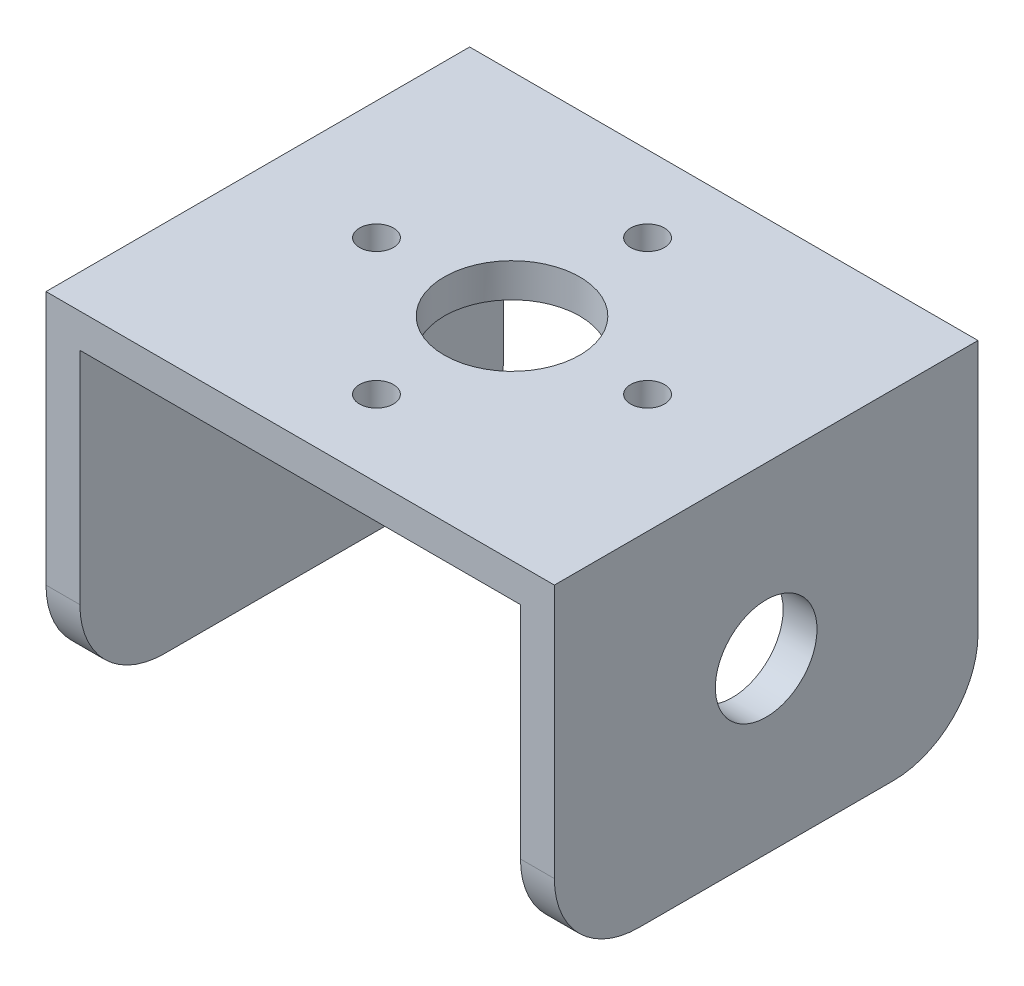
from build123d import *

# Parameters (mm, degrees)
SKETCH1_W           = 30
SKETCH1_H           = 25
BOSS_EXTRUDE1_DEPTH = 20
SHELL1_T            = -2
CUT_EXTRUDE1_REACH  = 29.951
SKETCH2_R           = 4
SKETCH2_R_2         = 1
SKETCH3_R           = 3
CUT_EXTRUDE2_DEPTH  = 39.160843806
FILLET1_R           = 5


with BuildPart() as part:
    # Sketch1 → Boss-Extrude1 (new body)
    with BuildSketch(Plane(origin=(0, 0, 0), x_dir=(1, 0, 0), z_dir=(0, 1, 0))):
        Rectangle(SKETCH1_W, SKETCH1_H)
    extrude(amount=-BOSS_EXTRUDE1_DEPTH)

    # Shell1
    shell1_openings = [part.faces().sort_by_distance(p)[0] for p in [
        (0, -20, 0),
        (0, -10, 12.5),
        (0, -10, -12.5),
    ]]
    offset(amount=SHELL1_T, openings=shell1_openings, kind=Kind.INTERSECTION)

    # Sketch2 → Cut-Extrude1 (cut, up to next)
    with BuildSketch(Plane(origin=(0, 0, 0), x_dir=(1, 0, 0), z_dir=(0, 1, 0)), mode=Mode.PRIVATE) as cut_extrude1_sk1:
        with Locations(Location((0, 0, 0), (0, 0, 270))):
            Circle(SKETCH2_R)
    cut_extrude1_tool1 = extrude(cut_extrude1_sk1.sketch, amount=-CUT_EXTRUDE1_REACH, mode=Mode.PRIVATE) & part.part
    # Sketch2 → Cut-Extrude1 (cut, up to next)
    with BuildSketch(Plane(origin=(0, 0, 0), x_dir=(1, 0, 0), z_dir=(0, 1, 0)), mode=Mode.PRIVATE) as cut_extrude1_sk2:
        with Locations(Location((0, 8, 0), (0, 0, 270))):
            Circle(SKETCH2_R_2)
    cut_extrude1_tool2 = extrude(cut_extrude1_sk2.sketch, amount=-CUT_EXTRUDE1_REACH, mode=Mode.PRIVATE) & part.part
    # Sketch2 → Cut-Extrude1 (cut, up to next)
    with BuildSketch(Plane(origin=(0, 0, 0), x_dir=(1, 0, 0), z_dir=(0, 1, 0)), mode=Mode.PRIVATE) as cut_extrude1_sk3:
        with Locations(Location((8, 0, 0), (0, 0, 270))):
            Circle(SKETCH2_R_2)
    cut_extrude1_tool3 = extrude(cut_extrude1_sk3.sketch, amount=-CUT_EXTRUDE1_REACH, mode=Mode.PRIVATE) & part.part
    # Sketch2 → Cut-Extrude1 (cut, up to next)
    with BuildSketch(Plane(origin=(0, 0, 0), x_dir=(1, 0, 0), z_dir=(0, 1, 0)), mode=Mode.PRIVATE) as cut_extrude1_sk4:
        with Locations(Location((0, -8, 0), (0, 0, 270))):
            Circle(SKETCH2_R_2)
    cut_extrude1_tool4 = extrude(cut_extrude1_sk4.sketch, amount=-CUT_EXTRUDE1_REACH, mode=Mode.PRIVATE) & part.part
    # Sketch2 → Cut-Extrude1 (cut, up to next)
    with BuildSketch(Plane(origin=(0, 0, 0), x_dir=(1, 0, 0), z_dir=(0, 1, 0)), mode=Mode.PRIVATE) as cut_extrude1_sk5:
        with Locations(Location((-8, 0, 0), (0, 0, 270))):
            Circle(SKETCH2_R_2)
    cut_extrude1_tool5 = extrude(cut_extrude1_sk5.sketch, amount=-CUT_EXTRUDE1_REACH, mode=Mode.PRIVATE) & part.part
    add(cut_extrude1_tool1.solids().sort_by_distance((0, 0, 0))[0], mode=Mode.SUBTRACT)
    add(cut_extrude1_tool2.solids().sort_by_distance((0, 0, -8))[0], mode=Mode.SUBTRACT)
    add(cut_extrude1_tool3.solids().sort_by_distance((8, 0, 0))[0], mode=Mode.SUBTRACT)
    add(cut_extrude1_tool4.solids().sort_by_distance((0, 0, 8))[0], mode=Mode.SUBTRACT)
    add(cut_extrude1_tool5.solids().sort_by_distance((-8, 0, 0))[0], mode=Mode.SUBTRACT)

    # Sketch3 → Cut-Extrude2 (cut, through all)
    with BuildSketch(Plane(origin=(15, 0, 0), x_dir=(0, 0, -1), z_dir=(1, 0, 0))):
        with Locations((0, -10)):
            Circle(SKETCH3_R)
    extrude(amount=-CUT_EXTRUDE2_DEPTH, mode=Mode.SUBTRACT)

    # Fillet1
    fillet1_edges = [part.edges().sort_by_distance(p)[0] for p in [
        (14, -20, 12.5),
        (-14, -20, -12.5),
        (-14, -20, 12.5),
        (14, -20, -12.5),
    ]]
    fillet(fillet1_edges, radius=FILLET1_R)


solid = part.part
